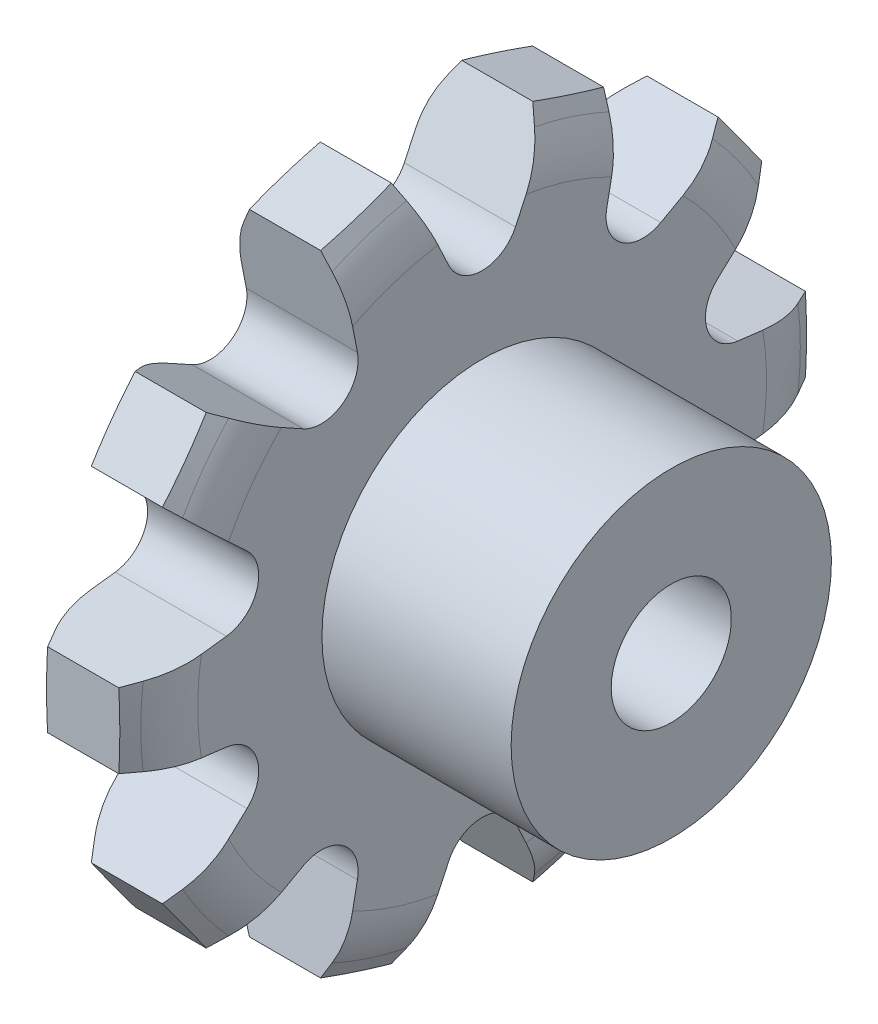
from build123d import *

# Parameters (mm, degrees)
ENL_V_MAT_EXTRU_1_DEPTH      = 11.1
ENL_V_MAT_EXTRU_1_DEPTH_BACK = 11.1
ESQUISSE2_R                  = 51.75


with BuildPart() as part:
    # Esquisse1 → R_volution1 (revolve)
    with BuildSketch(Plane.XY, mode=Mode.PRIVATE) as r_volution1_sk:
        with BuildLine():
            Line((0, 28.405267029), (0, 6))
            Line((0, 6), (30, 6))
            Line((30, 6), (30, 16))
            Line((30, 16), (11.1, 16))
            Line((11.1, 16), (11.1, 28.405267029))
            ThreePointArc((11.1, 28.405267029), (10.807221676, 30.745580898), (9.946932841, 32.941643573))
            Line((9.946932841, 32.941643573), (9.1, 34.5))
            Line((9.1, 34.5), (2, 34.5))
            Line((2, 34.5), (1.153067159, 32.941643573))
            ThreePointArc((1.153067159, 32.941643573), (0.292778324, 30.745580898), (0, 28.405267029))
        make_face()
    revolve(r_volution1_sk.sketch.rotate(Axis((30, 0, 0), (-1, 0, 0)), 270), axis=Axis((30, 0, 0), (-1, 0, 0)))

    # Esquisse2 → Enl_v. mat.-Extru.1 (cut, two sides: drawn at the far end of the back side and taken through both)
    with BuildSketch(Plane(origin=(5.55, 0, 0), x_dir=(0, 0, -1), z_dir=(1, 0, 0)).offset(-ENL_V_MAT_EXTRU_1_DEPTH_BACK)):
        Circle(ESQUISSE2_R)
        with BuildLine():
            Line((-34.299031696, 3.718390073), (-34.299031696, -3.718390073))
            Line((-34.299031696, -3.718390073), (-25.545059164, -4.793242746))
            ThreePointArc((-25.545059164, -4.793242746), (-22.493650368, -7.308630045), (-23.483784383, -11.137194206))
            Line((-23.483784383, -11.137194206), (-29.934114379, -17.152224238))
            Line((-29.934114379, -17.152224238), (-25.562884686, -23.168705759))
            Line((-25.562884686, -23.168705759), (-17.848989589, -18.892823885))
            ThreePointArc((-17.848989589, -18.892823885), (-13.901840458, -19.134241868), (-12.452502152, -22.813601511))
            Line((-12.452502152, -22.813601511), (-14.135382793, -31.471271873))
            Line((-14.135382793, -31.471271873), (-7.062584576, -33.769363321))
            Line((-7.062584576, -33.769363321), (-3.335212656, -25.775988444))
            ThreePointArc((-3.335212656, -25.775988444), (0, -23.651223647), (3.335212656, -25.775988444))
            Line((3.335212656, -25.775988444), (7.062584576, -33.769363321))
            Line((7.062584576, -33.769363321), (14.135382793, -31.471271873))
            Line((14.135382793, -31.471271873), (12.452502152, -22.813601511))
            ThreePointArc((12.452502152, -22.813601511), (13.901840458, -19.134241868), (17.848989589, -18.892823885))
            Line((17.848989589, -18.892823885), (25.562884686, -23.168705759))
            Line((25.562884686, -23.168705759), (29.934114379, -17.152224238))
            Line((29.934114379, -17.152224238), (23.483784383, -11.137194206))
            ThreePointArc((23.483784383, -11.137194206), (22.493650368, -7.308630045), (25.545059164, -4.793242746))
            Line((25.545059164, -4.793242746), (34.299031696, -3.718390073))
            Line((34.299031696, -3.718390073), (34.299031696, 3.718390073))
            Line((34.299031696, 3.718390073), (25.545059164, 4.793242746))
            ThreePointArc((25.545059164, 4.793242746), (22.493650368, 7.308630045), (23.483784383, 11.137194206))
            Line((23.483784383, 11.137194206), (29.934114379, 17.152224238))
            Line((29.934114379, 17.152224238), (25.562884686, 23.168705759))
            Line((25.562884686, 23.168705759), (17.848989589, 18.892823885))
            ThreePointArc((17.848989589, 18.892823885), (13.901840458, 19.134241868), (12.452502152, 22.813601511))
            Line((12.452502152, 22.813601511), (14.135382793, 31.471271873))
            Line((14.135382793, 31.471271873), (7.062584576, 33.769363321))
            Line((7.062584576, 33.769363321), (3.335212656, 25.775988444))
            ThreePointArc((3.335212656, 25.775988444), (0, 23.651223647), (-3.335212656, 25.775988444))
            Line((-3.335212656, 25.775988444), (-7.062584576, 33.769363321))
            Line((-7.062584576, 33.769363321), (-14.135382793, 31.471271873))
            Line((-14.135382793, 31.471271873), (-12.452502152, 22.813601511))
            ThreePointArc((-12.452502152, 22.813601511), (-13.901840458, 19.134241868), (-17.848989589, 18.892823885))
            Line((-17.848989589, 18.892823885), (-25.562884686, 23.168705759))
            Line((-25.562884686, 23.168705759), (-29.934114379, 17.152224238))
            Line((-29.934114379, 17.152224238), (-23.483784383, 11.137194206))
            ThreePointArc((-23.483784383, 11.137194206), (-22.493650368, 7.308630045), (-25.545059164, 4.793242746))
            Line((-25.545059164, 4.793242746), (-34.299031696, 3.718390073))
        make_face(mode=Mode.SUBTRACT)
    extrude(amount=ENL_V_MAT_EXTRU_1_DEPTH + ENL_V_MAT_EXTRU_1_DEPTH_BACK, mode=Mode.SUBTRACT)


solid = part.part
